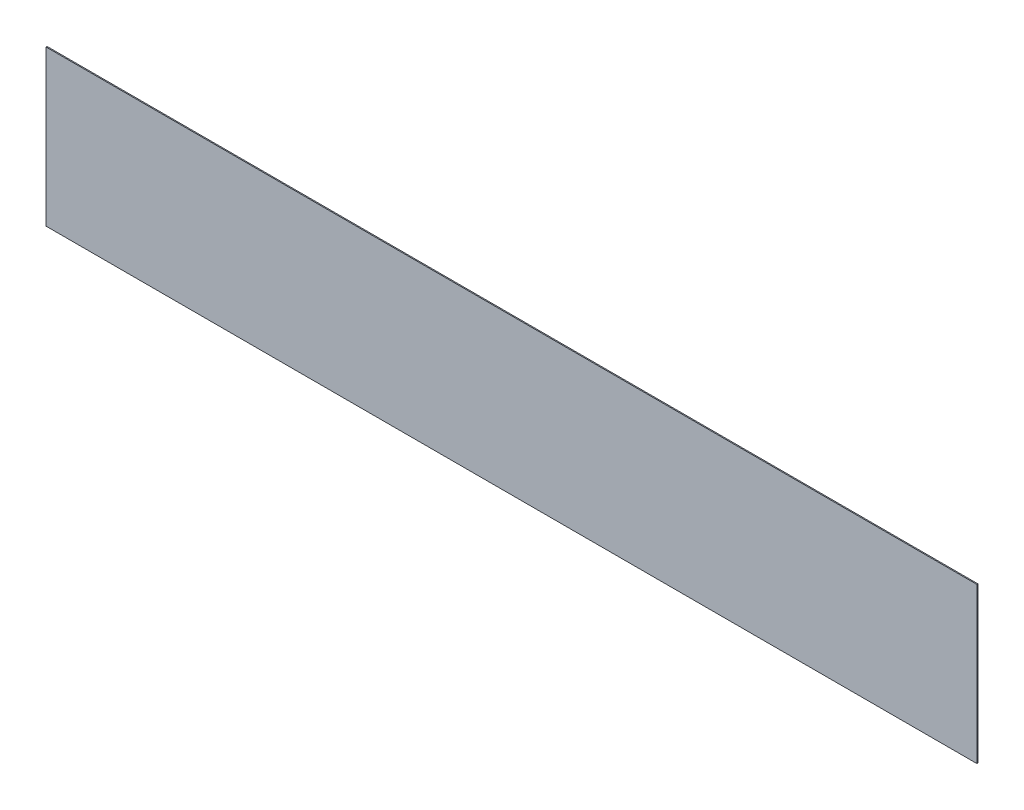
ISO-10303-21;
HEADER;
FILE_DESCRIPTION(('STEP AP214'),'2;1');
FILE_NAME('part.step','',(''),(''),'','','');
FILE_SCHEMA(('AUTOMOTIVE_DESIGN { 1 0 10303 214 1 1 1 1 }'));
ENDSEC;
DATA;
#1=APPLICATION_CONTEXT('core data for automotive mechanical design processes');
#2=APPLICATION_PROTOCOL_DEFINITION('international standard','automotive_design',2000,#1);
#3=PRODUCT_CONTEXT('',#1,'mechanical');
#4=PRODUCT('Part','Part','',(#3));
#5=PRODUCT_RELATED_PRODUCT_CATEGORY('part','',(#4));
#6=PRODUCT_DEFINITION_FORMATION('','',#4);
#7=PRODUCT_DEFINITION_CONTEXT('part definition',#1,'design');
#8=PRODUCT_DEFINITION('design','',#6,#7);
#9=PRODUCT_DEFINITION_SHAPE('','',#8);
#10=(LENGTH_UNIT() NAMED_UNIT(*) SI_UNIT(.MILLI.,.METRE.));
#11=(NAMED_UNIT(*) PLANE_ANGLE_UNIT() SI_UNIT($,.RADIAN.));
#12=(NAMED_UNIT(*) SI_UNIT($,.STERADIAN.) SOLID_ANGLE_UNIT());
#13=UNCERTAINTY_MEASURE_WITH_UNIT(LENGTH_MEASURE(1.E-05),#10,'distance_accuracy_value','');
#14=(GEOMETRIC_REPRESENTATION_CONTEXT(3) GLOBAL_UNCERTAINTY_ASSIGNED_CONTEXT((#13)) GLOBAL_UNIT_ASSIGNED_CONTEXT((#10,
#11,#12)) REPRESENTATION_CONTEXT('',''));
#15=CARTESIAN_POINT('',(0.,0.,0.));
#16=DIRECTION('',(0.,0.,1.));
#17=DIRECTION('',(1.,0.,0.));
#18=AXIS2_PLACEMENT_3D('',#15,#16,#17);
#19=CARTESIAN_POINT('',(0.,190.5,2.54));
#20=DIRECTION('',(1.,0.,0.));
#21=DIRECTION('',(0.,0.,-1.));
#22=AXIS2_PLACEMENT_3D('',#19,#20,#21);
#23=PLANE('',#22);
#24=DIRECTION('',(0.,-1.,0.));
#25=VECTOR('',#24,1.);
#26=CARTESIAN_POINT('',(0.,190.5,0.));
#27=LINE('',#26,#25);
#28=CARTESIAN_POINT('',(0.,190.5,0.));
#29=VERTEX_POINT('',#28);
#30=CARTESIAN_POINT('',(0.,-190.5,0.));
#31=VERTEX_POINT('',#30);
#32=EDGE_CURVE('E76',#29,#31,#27,.T.);
#33=ORIENTED_EDGE('',*,*,#32,.T.);
#34=DIRECTION('',(0.,0.,-1.));
#35=VECTOR('',#34,1.);
#36=CARTESIAN_POINT('',(0.,-190.5,2.54));
#37=LINE('',#36,#35);
#38=CARTESIAN_POINT('',(0.,-190.5,2.54));
#39=VERTEX_POINT('',#38);
#40=EDGE_CURVE('E11',#39,#31,#37,.T.);
#41=ORIENTED_EDGE('',*,*,#40,.F.);
#42=DIRECTION('',(0.,-1.,0.));
#43=VECTOR('',#42,1.);
#44=CARTESIAN_POINT('',(0.,190.5,2.54));
#45=LINE('',#44,#43);
#46=CARTESIAN_POINT('',(0.,190.5,2.54));
#47=VERTEX_POINT('',#46);
#48=EDGE_CURVE('E94',#47,#39,#45,.T.);
#49=ORIENTED_EDGE('',*,*,#48,.F.);
#50=DIRECTION('',(0.,0.,-1.));
#51=VECTOR('',#50,1.);
#52=CARTESIAN_POINT('',(0.,190.5,2.54));
#53=LINE('',#52,#51);
#54=EDGE_CURVE('E88',#47,#29,#53,.T.);
#55=ORIENTED_EDGE('',*,*,#54,.T.);
#56=EDGE_LOOP('',(#33,#41,#49,#55));
#57=FACE_BOUND('',#56,.T.);
#58=ADVANCED_FACE('F32',(#57),#23,.F.);
#59=CARTESIAN_POINT('',(0.,-190.5,2.54));
#60=DIRECTION('',(0.,1.,0.));
#61=DIRECTION('',(0.,0.,1.));
#62=AXIS2_PLACEMENT_3D('',#59,#60,#61);
#63=PLANE('',#62);
#64=DIRECTION('',(1.,0.,0.));
#65=VECTOR('',#64,1.);
#66=CARTESIAN_POINT('',(0.,-190.5,0.));
#67=LINE('',#66,#65);
#68=CARTESIAN_POINT('',(2286.,-190.5,0.));
#69=VERTEX_POINT('',#68);
#70=EDGE_CURVE('E72',#31,#69,#67,.T.);
#71=ORIENTED_EDGE('',*,*,#70,.T.);
#72=DIRECTION('',(0.,0.,-1.));
#73=VECTOR('',#72,1.);
#74=CARTESIAN_POINT('',(2286.,-190.5,2.54));
#75=LINE('',#74,#73);
#76=CARTESIAN_POINT('',(2286.,-190.5,2.54));
#77=VERTEX_POINT('',#76);
#78=EDGE_CURVE('E39',#77,#69,#75,.T.);
#79=ORIENTED_EDGE('',*,*,#78,.F.);
#80=DIRECTION('',(1.,0.,0.));
#81=VECTOR('',#80,1.);
#82=CARTESIAN_POINT('',(0.,-190.5,2.54));
#83=LINE('',#82,#81);
#84=EDGE_CURVE('E84',#39,#77,#83,.T.);
#85=ORIENTED_EDGE('',*,*,#84,.F.);
#86=ORIENTED_EDGE('',*,*,#40,.T.);
#87=EDGE_LOOP('',(#71,#79,#85,#86));
#88=FACE_BOUND('',#87,.T.);
#89=ADVANCED_FACE('F83',(#88),#63,.F.);
#90=CARTESIAN_POINT('',(2286.,190.5,2.54));
#91=DIRECTION('',(-1.,0.,0.));
#92=DIRECTION('',(0.,0.,1.));
#93=AXIS2_PLACEMENT_3D('',#90,#91,#92);
#94=PLANE('',#93);
#95=DIRECTION('',(0.,1.,0.));
#96=VECTOR('',#95,1.);
#97=CARTESIAN_POINT('',(2286.,190.5,0.));
#98=LINE('',#97,#96);
#99=CARTESIAN_POINT('',(2286.,190.5,0.));
#100=VERTEX_POINT('',#99);
#101=EDGE_CURVE('E77',#69,#100,#98,.T.);
#102=ORIENTED_EDGE('',*,*,#101,.T.);
#103=DIRECTION('',(0.,0.,-1.));
#104=VECTOR('',#103,1.);
#105=CARTESIAN_POINT('',(2286.,190.5,2.54));
#106=LINE('',#105,#104);
#107=CARTESIAN_POINT('',(2286.,190.5,2.54));
#108=VERTEX_POINT('',#107);
#109=EDGE_CURVE('E100',#108,#100,#106,.T.);
#110=ORIENTED_EDGE('',*,*,#109,.F.);
#111=DIRECTION('',(0.,1.,0.));
#112=VECTOR('',#111,1.);
#113=CARTESIAN_POINT('',(2286.,190.5,2.54));
#114=LINE('',#113,#112);
#115=EDGE_CURVE('E51',#77,#108,#114,.T.);
#116=ORIENTED_EDGE('',*,*,#115,.F.);
#117=ORIENTED_EDGE('',*,*,#78,.T.);
#118=EDGE_LOOP('',(#102,#110,#116,#117));
#119=FACE_BOUND('',#118,.T.);
#120=ADVANCED_FACE('F103',(#119),#94,.F.);
#121=CARTESIAN_POINT('',(0.,190.5,2.54));
#122=DIRECTION('',(0.,-1.,0.));
#123=DIRECTION('',(0.,0.,-1.));
#124=AXIS2_PLACEMENT_3D('',#121,#122,#123);
#125=PLANE('',#124);
#126=DIRECTION('',(-1.,0.,0.));
#127=VECTOR('',#126,1.);
#128=CARTESIAN_POINT('',(0.,190.5,0.));
#129=LINE('',#128,#127);
#130=EDGE_CURVE('E92',#100,#29,#129,.T.);
#131=ORIENTED_EDGE('',*,*,#130,.T.);
#132=ORIENTED_EDGE('',*,*,#54,.F.);
#133=DIRECTION('',(-1.,0.,0.));
#134=VECTOR('',#133,1.);
#135=CARTESIAN_POINT('',(0.,190.5,2.54));
#136=LINE('',#135,#134);
#137=EDGE_CURVE('E46',#108,#47,#136,.T.);
#138=ORIENTED_EDGE('',*,*,#137,.F.);
#139=ORIENTED_EDGE('',*,*,#109,.T.);
#140=EDGE_LOOP('',(#131,#132,#138,#139));
#141=FACE_BOUND('',#140,.T.);
#142=ADVANCED_FACE('F105',(#141),#125,.F.);
#143=CARTESIAN_POINT('',(0.,-190.5,2.54));
#144=DIRECTION('',(0.,0.,1.));
#145=DIRECTION('',(1.,0.,0.));
#146=AXIS2_PLACEMENT_3D('',#143,#144,#145);
#147=PLANE('',#146);
#148=ORIENTED_EDGE('',*,*,#48,.T.);
#149=ORIENTED_EDGE('',*,*,#84,.T.);
#150=ORIENTED_EDGE('',*,*,#115,.T.);
#151=ORIENTED_EDGE('',*,*,#137,.T.);
#152=EDGE_LOOP('',(#148,#149,#150,#151));
#153=FACE_BOUND('',#152,.T.);
#154=ADVANCED_FACE('F106',(#153),#147,.T.);
#155=CARTESIAN_POINT('',(0.,-190.5,0.));
#156=DIRECTION('',(0.,0.,1.));
#157=DIRECTION('',(1.,0.,0.));
#158=AXIS2_PLACEMENT_3D('',#155,#156,#157);
#159=PLANE('',#158);
#160=ORIENTED_EDGE('',*,*,#32,.F.);
#161=ORIENTED_EDGE('',*,*,#130,.F.);
#162=ORIENTED_EDGE('',*,*,#101,.F.);
#163=ORIENTED_EDGE('',*,*,#70,.F.);
#164=EDGE_LOOP('',(#160,#161,#162,#163));
#165=FACE_BOUND('',#164,.T.);
#166=ADVANCED_FACE('F73',(#165),#159,.F.);
#167=CLOSED_SHELL('',(#58,#89,#120,#142,#154,#166));
#168=MANIFOLD_SOLID_BREP('B2',#167);
#169=ADVANCED_BREP_SHAPE_REPRESENTATION('',(#18,#168),#14);
#170=SHAPE_DEFINITION_REPRESENTATION(#9,#169);
ENDSEC;
END-ISO-10303-21;
